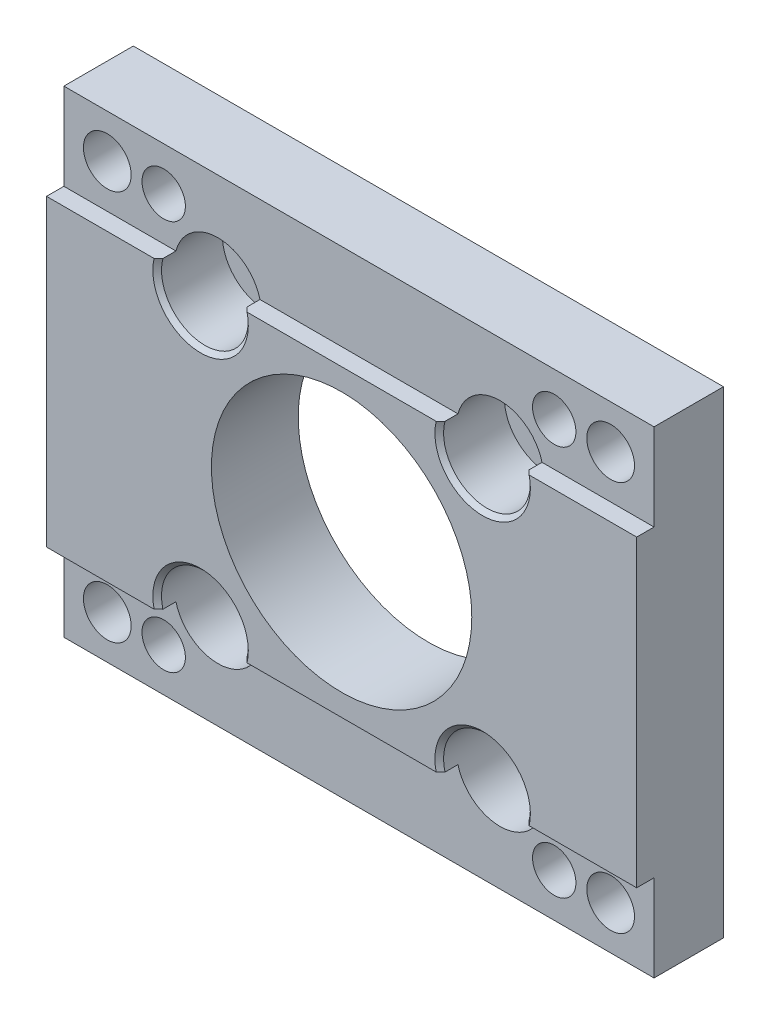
from build123d import *

# Parameters (mm, degrees)
ESQUISSE1_W                                     = 68
ESQUISSE1_H                                     = 55
ESQUISSE1_R                                     = 15
EXTRUSION1_DEPTH                                = 10
R_P_TITION_LIN_AIRE1_COUNT                      = 2
R_P_TITION_LIN_AIRE1_PITCH                      = 32.5
R_P_TITION_LIN_AIRE1_COUNT_DIR2                 = 2
R_P_TITION_LIN_AIRE1_PITCH_DIR2                 = 32.5
D_GAGEMENT_M51_D                                = 5.5
D_GAGEMENT_M51_CSINK_D                          = 6
D_GAGEMENT_M51_CSINK_ANGLE                      = 90
R_P_TITION_LIN_AIRE2_COUNT                      = 2
R_P_TITION_LIN_AIRE2_PITCH                      = 58
R_P_TITION_LIN_AIRE2_COUNT_DIR2                 = 2
R_P_TITION_LIN_AIRE2_PITCH_DIR2                 = 45
DIAM_TRE_DU_PER_AGE_M5_0_5_000000_1_D           = 5
DIAM_TRE_DU_PER_AGE_M5_0_5_000000_1_CSINK_D     = 6
DIAM_TRE_DU_PER_AGE_M5_0_5_000000_1_CSINK_ANGLE = 90
R_P_TITION_LIN_AIRE3_COUNT                      = 2
R_P_TITION_LIN_AIRE3_PITCH                      = 45
R_P_TITION_LIN_AIRE3_COUNT_DIR2                 = 2
R_P_TITION_LIN_AIRE3_PITCH_DIR2                 = 45
ESQUISSE13_W                                    = 2
ESQUISSE13_H                                    = 10
ENL_V_MAT_EXTRU_1_DEPTH                         = 75.028710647


with BuildPart() as part:
    # Esquisse1 → Extrusion1 (new body)
    with BuildSketch(Plane.XY):
        Rectangle(ESQUISSE1_W, ESQUISSE1_H)
        Circle(ESQUISSE1_R, mode=Mode.SUBTRACT)
    extrude(amount=EXTRUSION1_DEPTH)

    # Esquisse2 → Chambrage pour vis _ t_te hexagonale M51 (revolve, cut)
    with BuildSketch(Plane(origin=(-16.25, 16.25, 10), x_dir=(0, -1, 0), z_dir=(1, 0, 0))):
        Polygon((0, 0), (0, 10), (2.75, 10), (2.75, 7.5), (5, 7.5), (5, 0.5), (5.5, 0), align=None)
    chambrage_pour_vis_t_te_hexagonale_m51 = revolve(axis=Axis((-16.25, 16.25, 16.35), (0, 0, -1)), mode=Mode.SUBTRACT)

    # R_p_tition lin_aire1: Chambrage pour vis _ t_te hexagonale M51 2 × 2
    with Locations(*[(i * R_P_TITION_LIN_AIRE1_PITCH, -j * R_P_TITION_LIN_AIRE1_PITCH_DIR2, 0) for i in range(R_P_TITION_LIN_AIRE1_COUNT) for j in range(R_P_TITION_LIN_AIRE1_COUNT_DIR2) if (i, j) != (0, 0)]):
        add(chambrage_pour_vis_t_te_hexagonale_m51, mode=Mode.SUBTRACT)

    # D_gagement M51 (through all)
    with Locations(Plane(origin=(-29, -22.5, 0), x_dir=(-1, 0, 0), z_dir=(0, 0, -1))):
        with Locations((0, 0)):
            d_gagement_m51 = CounterSinkHole(D_GAGEMENT_M51_D / 2, D_GAGEMENT_M51_CSINK_D / 2, counter_sink_angle=D_GAGEMENT_M51_CSINK_ANGLE)

    # R_p_tition lin_aire2: D_gagement M51 2 × 2
    with Locations(*[(i * R_P_TITION_LIN_AIRE2_PITCH, j * R_P_TITION_LIN_AIRE2_PITCH_DIR2, 0) for i in range(R_P_TITION_LIN_AIRE2_COUNT) for j in range(R_P_TITION_LIN_AIRE2_COUNT_DIR2) if (i, j) != (0, 0)]):
        add(d_gagement_m51, mode=Mode.SUBTRACT)

    # Diam_tre du per_age M5.0 _5.000000_1 (through all)
    with Locations(Plane(origin=(-22.5, -22.5, 0), x_dir=(-1, 0, 0), z_dir=(0, 0, -1))):
        with Locations((0, 0)):
            diam_tre_du_per_age_m5_0_5_000000_1 = CounterSinkHole(DIAM_TRE_DU_PER_AGE_M5_0_5_000000_1_D / 2, DIAM_TRE_DU_PER_AGE_M5_0_5_000000_1_CSINK_D / 2, counter_sink_angle=DIAM_TRE_DU_PER_AGE_M5_0_5_000000_1_CSINK_ANGLE)

    # R_p_tition lin_aire3: Diam_tre du per_age M5.0 _5.000000_1 2 × 2
    with Locations(*[(i * R_P_TITION_LIN_AIRE3_PITCH, j * R_P_TITION_LIN_AIRE3_PITCH_DIR2, 0) for i in range(R_P_TITION_LIN_AIRE3_COUNT) for j in range(R_P_TITION_LIN_AIRE3_COUNT_DIR2) if (i, j) != (0, 0)]):
        add(diam_tre_du_per_age_m5_0_5_000000_1, mode=Mode.SUBTRACT)

    # Esquisse13 → Enl_v. mat.-Extru.1 (cut, through all)
    with BuildSketch(Plane.ZY.offset(34)):
        with Locations((9, 22.5)):
            Rectangle(ESQUISSE13_W, ESQUISSE13_H)
    enl_v_mat_extru_1 = extrude(amount=-ENL_V_MAT_EXTRU_1_DEPTH, mode=Mode.SUBTRACT)

    # Sym_trie1: Enl_v. mat.-Extru.1 across plane
    add(enl_v_mat_extru_1.mirror(Plane.ZX), mode=Mode.SUBTRACT)


solid = part.part
